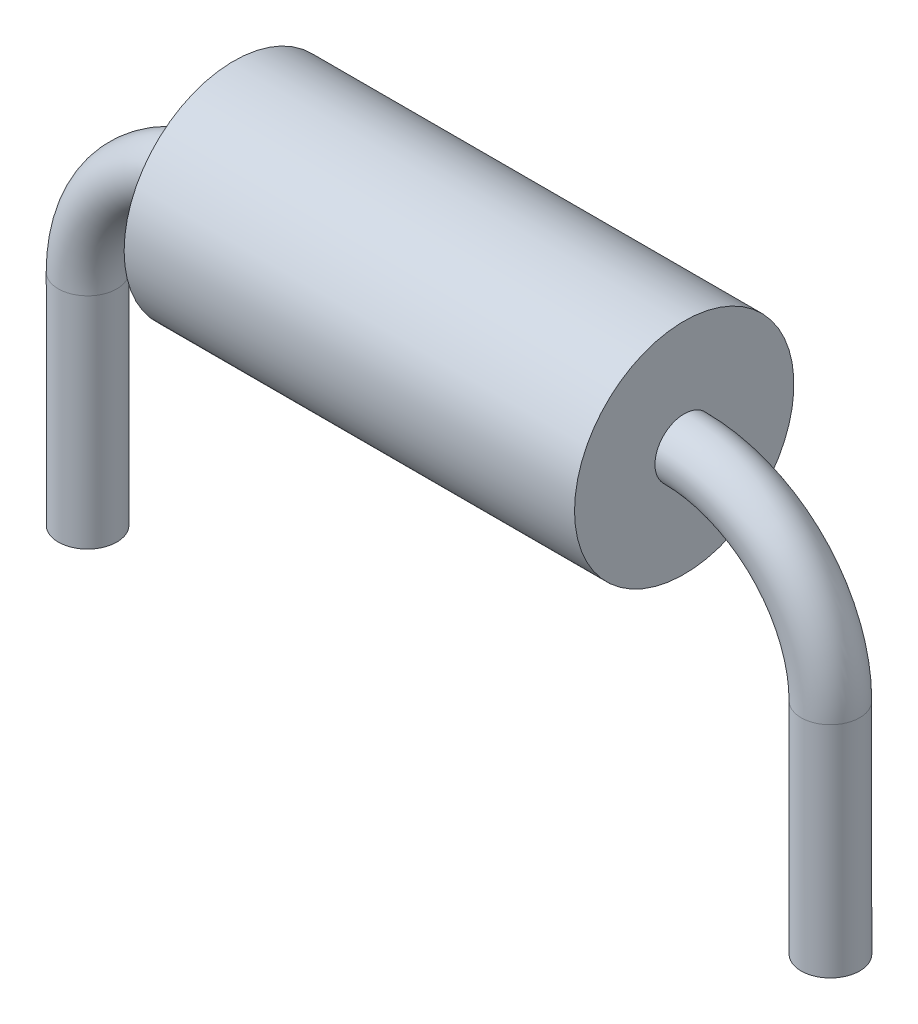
ISO-10303-21;
HEADER;
FILE_DESCRIPTION(('STEP AP214'),'2;1');
FILE_NAME('part.step','',(''),(''),'','','');
FILE_SCHEMA(('AUTOMOTIVE_DESIGN { 1 0 10303 214 1 1 1 1 }'));
ENDSEC;
DATA;
#1=APPLICATION_CONTEXT('core data for automotive mechanical design processes');
#2=APPLICATION_PROTOCOL_DEFINITION('international standard','automotive_design',2000,#1);
#3=PRODUCT_CONTEXT('',#1,'mechanical');
#4=PRODUCT('Part','Part','',(#3));
#5=PRODUCT_RELATED_PRODUCT_CATEGORY('part','',(#4));
#6=PRODUCT_DEFINITION_FORMATION('','',#4);
#7=PRODUCT_DEFINITION_CONTEXT('part definition',#1,'design');
#8=PRODUCT_DEFINITION('design','',#6,#7);
#9=PRODUCT_DEFINITION_SHAPE('','',#8);
#10=(LENGTH_UNIT() NAMED_UNIT(*) SI_UNIT(.MILLI.,.METRE.));
#11=(NAMED_UNIT(*) PLANE_ANGLE_UNIT() SI_UNIT($,.RADIAN.));
#12=(NAMED_UNIT(*) SI_UNIT($,.STERADIAN.) SOLID_ANGLE_UNIT());
#13=UNCERTAINTY_MEASURE_WITH_UNIT(LENGTH_MEASURE(1.E-05),#10,'distance_accuracy_value','');
#14=(GEOMETRIC_REPRESENTATION_CONTEXT(3) GLOBAL_UNCERTAINTY_ASSIGNED_CONTEXT((#13)) GLOBAL_UNIT_ASSIGNED_CONTEXT((#10,
#11,#12)) REPRESENTATION_CONTEXT('',''));
#15=CARTESIAN_POINT('',(0.,0.,0.));
#16=DIRECTION('',(0.,0.,1.));
#17=DIRECTION('',(1.,0.,0.));
#18=AXIS2_PLACEMENT_3D('',#15,#16,#17);
#19=CARTESIAN_POINT('',(10.16,2.99999999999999,0.));
#20=DIRECTION('',(0.,-1.,0.));
#21=DIRECTION('',(0.,0.,-1.));
#22=AXIS2_PLACEMENT_3D('',#19,#20,#21);
#23=CYLINDRICAL_SURFACE('',#22,0.4);
#24=CARTESIAN_POINT('',(10.16,2.99999999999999,0.));
#25=DIRECTION('',(0.,-1.,0.));
#26=DIRECTION('',(0.,0.,1.));
#27=AXIS2_PLACEMENT_3D('',#24,#25,#26);
#28=CIRCLE('',#27,0.4);
#29=CARTESIAN_POINT('',(10.56,2.99999999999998,0.));
#30=VERTEX_POINT('',#29);
#31=EDGE_CURVE('E41',#30,#30,#28,.T.);
#32=ORIENTED_EDGE('',*,*,#31,.T.);
#33=EDGE_LOOP('',(#32));
#34=FACE_BOUND('',#33,.T.);
#35=CARTESIAN_POINT('',(10.16,0.,0.));
#36=DIRECTION('',(0.,-1.,0.));
#37=DIRECTION('',(0.,0.,1.));
#38=AXIS2_PLACEMENT_3D('',#35,#36,#37);
#39=CIRCLE('',#38,0.4);
#40=CARTESIAN_POINT('',(10.16,0.,0.4));
#41=VERTEX_POINT('',#40);
#42=EDGE_CURVE('E10',#41,#41,#39,.T.);
#43=ORIENTED_EDGE('',*,*,#42,.F.);
#44=EDGE_LOOP('',(#43));
#45=FACE_BOUND('',#44,.T.);
#46=ADVANCED_FACE('F35',(#34,#45),#23,.T.);
#47=CARTESIAN_POINT('',(8.16,3.,0.));
#48=DIRECTION('',(0.,0.,-1.));
#49=DIRECTION('',(-1.,0.,0.));
#50=AXIS2_PLACEMENT_3D('',#47,#48,#49);
#51=TOROIDAL_SURFACE('',#50,2.,0.4);
#52=CARTESIAN_POINT('',(8.15999999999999,5.,0.));
#53=DIRECTION('',(-1.,0.,0.));
#54=DIRECTION('',(0.,0.,1.));
#55=AXIS2_PLACEMENT_3D('',#52,#53,#54);
#56=CIRCLE('',#55,0.4);
#57=CARTESIAN_POINT('',(8.15999999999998,5.4,0.));
#58=VERTEX_POINT('',#57);
#59=EDGE_CURVE('E55',#58,#58,#56,.F.);
#60=CARTESIAN_POINT('',(8.16,3.,0.));
#61=DIRECTION('',(0.,0.,-1.));
#62=DIRECTION('',(-1.,0.,0.));
#63=AXIS2_PLACEMENT_3D('',#60,#61,#62);
#64=CIRCLE('',#63,2.4);
#65=EDGE_CURVE('',#58,#30,#64,.T.);
#66=ORIENTED_EDGE('',*,*,#59,.T.);
#67=ORIENTED_EDGE('',*,*,#31,.F.);
#68=ORIENTED_EDGE('',*,*,#65,.T.);
#69=ORIENTED_EDGE('',*,*,#65,.F.);
#70=EDGE_LOOP('',(#66,#68,#67,#69));
#71=FACE_BOUND('',#70,.T.);
#72=ADVANCED_FACE('F88',(#71),#51,.T.);
#73=CARTESIAN_POINT('',(10.16,0.,0.));
#74=DIRECTION('',(0.,-1.,0.));
#75=DIRECTION('',(0.,0.,1.));
#76=AXIS2_PLACEMENT_3D('',#73,#74,#75);
#77=PLANE('',#76);
#78=ORIENTED_EDGE('',*,*,#42,.T.);
#79=EDGE_LOOP('',(#78));
#80=FACE_BOUND('',#79,.T.);
#81=ADVANCED_FACE('F83',(#80),#77,.T.);
#82=CARTESIAN_POINT('',(2.00000000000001,6.5,0.));
#83=DIRECTION('',(1.,0.,0.));
#84=DIRECTION('',(0.,0.,-1.));
#85=AXIS2_PLACEMENT_3D('',#82,#83,#84);
#86=PLANE('',#85);
#87=CARTESIAN_POINT('',(2.00000000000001,5.,0.));
#88=DIRECTION('',(1.,0.,0.));
#89=DIRECTION('',(0.,0.,1.));
#90=AXIS2_PLACEMENT_3D('',#87,#88,#89);
#91=CIRCLE('',#90,0.4);
#92=CARTESIAN_POINT('',(2.00000000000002,5.4,0.));
#93=VERTEX_POINT('',#92);
#94=EDGE_CURVE('E45',#93,#93,#91,.T.);
#95=ORIENTED_EDGE('',*,*,#94,.T.);
#96=EDGE_LOOP('',(#95));
#97=FACE_BOUND('',#96,.T.);
#98=CARTESIAN_POINT('',(2.00000000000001,5.,0.));
#99=DIRECTION('',(-1.,0.,0.));
#100=DIRECTION('',(0.,0.,1.));
#101=AXIS2_PLACEMENT_3D('',#98,#99,#100);
#102=CIRCLE('',#101,1.5);
#103=CARTESIAN_POINT('',(2.00000000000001,5.,1.5));
#104=VERTEX_POINT('',#103);
#105=EDGE_CURVE('E63',#104,#104,#102,.T.);
#106=ORIENTED_EDGE('',*,*,#105,.T.);
#107=EDGE_LOOP('',(#106));
#108=FACE_BOUND('',#107,.T.);
#109=ADVANCED_FACE('F67',(#97,#108),#86,.F.);
#110=CARTESIAN_POINT('',(8.15999999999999,6.5,0.));
#111=DIRECTION('',(-1.,0.,0.));
#112=DIRECTION('',(0.,0.,1.));
#113=AXIS2_PLACEMENT_3D('',#110,#111,#112);
#114=PLANE('',#113);
#115=ORIENTED_EDGE('',*,*,#59,.F.);
#116=EDGE_LOOP('',(#115));
#117=FACE_BOUND('',#116,.T.);
#118=CARTESIAN_POINT('',(8.15999999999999,5.,0.));
#119=DIRECTION('',(-1.,0.,0.));
#120=DIRECTION('',(0.,0.,1.));
#121=AXIS2_PLACEMENT_3D('',#118,#119,#120);
#122=CIRCLE('',#121,1.5);
#123=CARTESIAN_POINT('',(8.15999999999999,5.,1.5));
#124=VERTEX_POINT('',#123);
#125=EDGE_CURVE('E60',#124,#124,#122,.T.);
#126=ORIENTED_EDGE('',*,*,#125,.F.);
#127=EDGE_LOOP('',(#126));
#128=FACE_BOUND('',#127,.T.);
#129=ADVANCED_FACE('F73',(#117,#128),#114,.F.);
#130=CARTESIAN_POINT('',(2.00000000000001,5.,0.));
#131=DIRECTION('',(-1.,0.,0.));
#132=DIRECTION('',(0.,0.,1.));
#133=AXIS2_PLACEMENT_3D('',#130,#131,#132);
#134=CYLINDRICAL_SURFACE('',#133,1.5);
#135=ORIENTED_EDGE('',*,*,#105,.F.);
#136=EDGE_LOOP('',(#135));
#137=FACE_BOUND('',#136,.T.);
#138=ORIENTED_EDGE('',*,*,#125,.T.);
#139=EDGE_LOOP('',(#138));
#140=FACE_BOUND('',#139,.T.);
#141=ADVANCED_FACE('F69',(#137,#140),#134,.T.);
#142=CARTESIAN_POINT('',(0.,0.,0.));
#143=DIRECTION('',(0.,1.,0.));
#144=DIRECTION('',(0.,0.,1.));
#145=AXIS2_PLACEMENT_3D('',#142,#143,#144);
#146=PLANE('',#145);
#147=CARTESIAN_POINT('',(0.,0.,0.));
#148=DIRECTION('',(0.,1.,0.));
#149=DIRECTION('',(0.,0.,1.));
#150=AXIS2_PLACEMENT_3D('',#147,#148,#149);
#151=CIRCLE('',#150,0.4);
#152=CARTESIAN_POINT('',(0.,0.,0.4));
#153=VERTEX_POINT('',#152);
#154=EDGE_CURVE('E52',#153,#153,#151,.T.);
#155=ORIENTED_EDGE('',*,*,#154,.F.);
#156=EDGE_LOOP('',(#155));
#157=FACE_BOUND('',#156,.T.);
#158=ADVANCED_FACE('F72',(#157),#146,.F.);
#159=CARTESIAN_POINT('',(0.,2.99999999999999,0.));
#160=DIRECTION('',(0.,-1.,0.));
#161=DIRECTION('',(0.,0.,-1.));
#162=AXIS2_PLACEMENT_3D('',#159,#160,#161);
#163=CYLINDRICAL_SURFACE('',#162,0.4);
#164=CARTESIAN_POINT('',(0.,2.99999999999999,0.));
#165=DIRECTION('',(0.,1.,0.));
#166=DIRECTION('',(0.,0.,1.));
#167=AXIS2_PLACEMENT_3D('',#164,#165,#166);
#168=CIRCLE('',#167,0.4);
#169=CARTESIAN_POINT('',(-0.4,2.99999999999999,0.));
#170=VERTEX_POINT('',#169);
#171=EDGE_CURVE('E49',#170,#170,#168,.T.);
#172=ORIENTED_EDGE('',*,*,#171,.F.);
#173=EDGE_LOOP('',(#172));
#174=FACE_BOUND('',#173,.T.);
#175=ORIENTED_EDGE('',*,*,#154,.T.);
#176=EDGE_LOOP('',(#175));
#177=FACE_BOUND('',#176,.T.);
#178=ADVANCED_FACE('F103',(#174,#177),#163,.T.);
#179=CARTESIAN_POINT('',(2.,3.,0.));
#180=DIRECTION('',(0.,0.,-1.));
#181=DIRECTION('',(-1.,0.,0.));
#182=AXIS2_PLACEMENT_3D('',#179,#180,#181);
#183=TOROIDAL_SURFACE('',#182,2.,0.4);
#184=CARTESIAN_POINT('',(2.,3.,0.));
#185=DIRECTION('',(0.,0.,-1.));
#186=DIRECTION('',(-1.,0.,0.));
#187=AXIS2_PLACEMENT_3D('',#184,#185,#186);
#188=CIRCLE('',#187,2.4);
#189=EDGE_CURVE('',#170,#93,#188,.T.);
#190=ORIENTED_EDGE('',*,*,#171,.T.);
#191=ORIENTED_EDGE('',*,*,#94,.F.);
#192=ORIENTED_EDGE('',*,*,#189,.T.);
#193=ORIENTED_EDGE('',*,*,#189,.F.);
#194=EDGE_LOOP('',(#190,#192,#191,#193));
#195=FACE_BOUND('',#194,.T.);
#196=ADVANCED_FACE('F100',(#195),#183,.T.);
#197=CLOSED_SHELL('',(#46,#72,#81,#109,#129,#141,#158,#178,#196));
#198=MANIFOLD_SOLID_BREP('B2',#197);
#199=ADVANCED_BREP_SHAPE_REPRESENTATION('',(#18,#198),#14);
#200=SHAPE_DEFINITION_REPRESENTATION(#9,#199);
ENDSEC;
END-ISO-10303-21;
